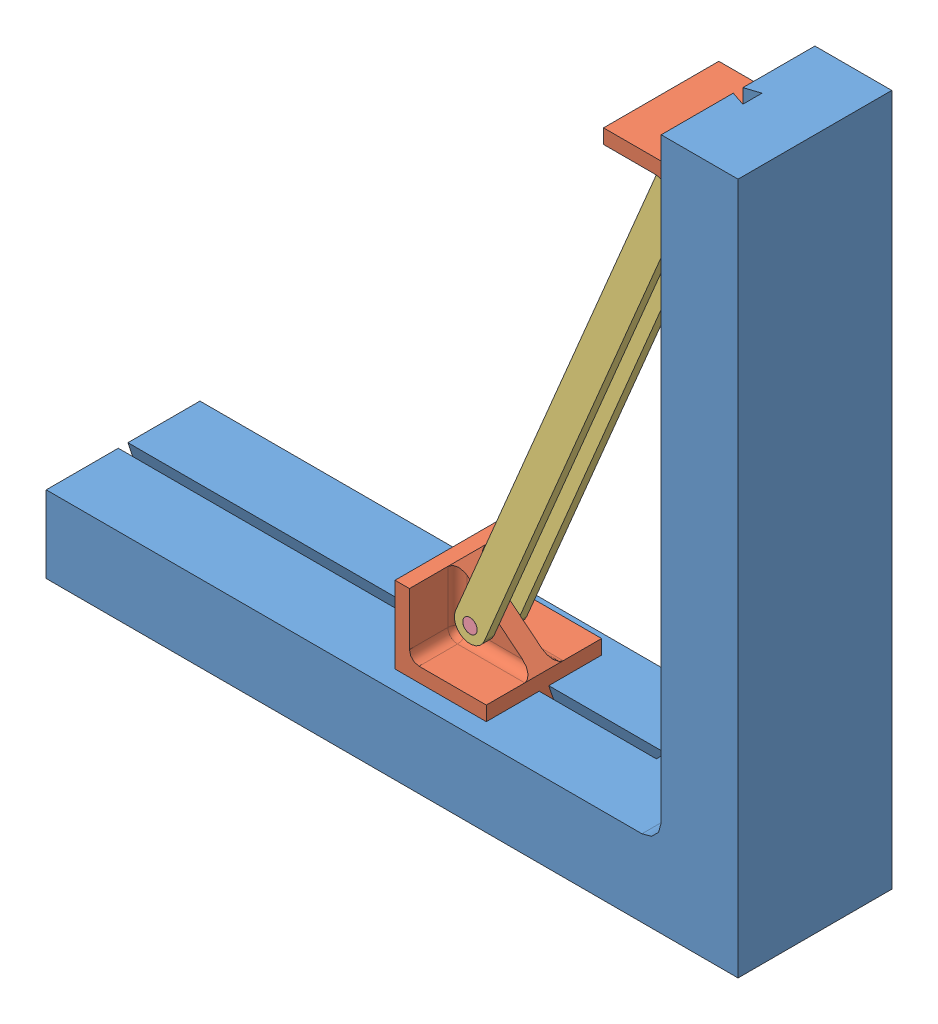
SolidWorks assembly Link Assy.SLDASM, configuration All Components (file format 3400). Lengths in mm.
Overall size (914.4 914.4 203.2).
7 component instances, 4 part files, 15 mates.
Components (placement in the parent):
- Track-1: Track.SLDPRT [Default] at origin size (914.4 914.4 203.2)
- Load Plate-1: Load Plate.SLDPRT [Default] at (-101.6 858.8376 0) x (0 0 1) z (-1 0 0) size (152.4 120.65 120.65)
- Load Plate-2: Load Plate.SLDPRT [Default] at (-478.7808 101.6 0) x (0 0 -1) z (0 1 0) size (152.4 120.65 120.65)
- link-1: link.SLDPRT [Default] at (-427.9808 152.4 -27.94) x (0.387487 0.921875 0) z (0 0 1) size (752.48 41.27 12.7)
- link-2: link.SLDPRT [Default] at (-427.9808 152.4 15.24) x (0.387487 0.921875 0) z (0 0 1) size (752.48 41.27 12.7)
- Pin-1: Pin.SLDPRT [Default] at (-152.4 808.0376 27.94) x (-0.996939 -0.078179 0) z (0.078179 -0.996939 0) size (19.05 55.88 19.05)
- Pin-2: Pin.SLDPRT [Default] at (-427.9808 152.4 27.94) x (0.066509 0.997786 0) z (-0.997786 0.066509 0) size (19.05 55.88 19.05)
Mates (geometry in assembly coordinates):
- Coincident6: coincident anti-aligned: plane of Track-1 through (-101.6 -31.75 6.35) normal (0.316228 0 -0.948683); plane of Load Plate-1 through (-101.6 738.1876 6.35) normal (-0.316228 0 0.948683)
- Coincident5: coincident anti-aligned: plane of Track-1 through (-101.6 -31.75 -6.35) normal (0.316228 0 0.948683); plane of Load Plate-1 through (-101.6 738.1876 -6.35) normal (-0.316228 0 -0.948683)
- Coincident7: coincident anti-aligned: plane of Track-1 through (31.75 101.6 -6.35) normal (0 -0.316228 0.948683); plane of Load Plate-2 through (-358.1308 101.6 -6.35) normal (0 0.316228 -0.948683)
- Coincident9: coincident anti-aligned: plane of Track-1 through (31.75 101.6 6.35) normal (0 -0.316228 -0.948683); plane of Load Plate-2 through (-358.1308 101.6 6.35) normal (0 0.316228 0.948683)
- Concentric3: concentric aligned: cylinder of Load Plate-2; cylinder of link-1
- Distance1: distance = 2.54 mm anti-aligned: plane of Load Plate-2 through (-459.7308 120.65 -12.7) normal (0 0 -1); plane of link-1 through (-427.9808 152.4 -15.24) normal (0 0 1)
- Concentric4: concentric anti-aligned: cylinder of Load Plate-1; cylinder of link-1
- Concentric5: concentric anti-aligned: cylinder of Load Plate-1; cylinder of link-2
- Concentric6: concentric aligned: cylinder of Load Plate-2; cylinder of link-2
- Distance2: distance = 2.54 mm anti-aligned: plane of Load Plate-2 through (-459.7308 120.65 12.7) normal (0 0 1); plane of link-2 through (-427.9808 152.4 15.24) normal (0 0 -1)
- Concentric7: concentric anti-aligned: cylinder of link-2; cylinder of Pin-2
- Coincident12: coincident aligned: plane of link-2 through (-427.9808 152.4 27.94) normal (0 0 1); plane of Pin-2 through (-427.9808 152.4 27.94) normal (0 0 1)
- Coincident13: coincident aligned: plane of link-2 through (-427.9808 152.4 27.94) normal (0 0 1); plane of Pin-1 through (-152.4 808.0376 27.94) normal (0 0 1)
- Concentric8: concentric anti-aligned: cylinder of link-2; cylinder of Pin-1
- Distance3: distance = 435.6192 mm aligned: plane of Track-1 through (-914.4 0 101.6) normal (-1 0 0); plane of Load Plate-2 through (-478.7808 101.6 76.2) normal (-1 0 0)
